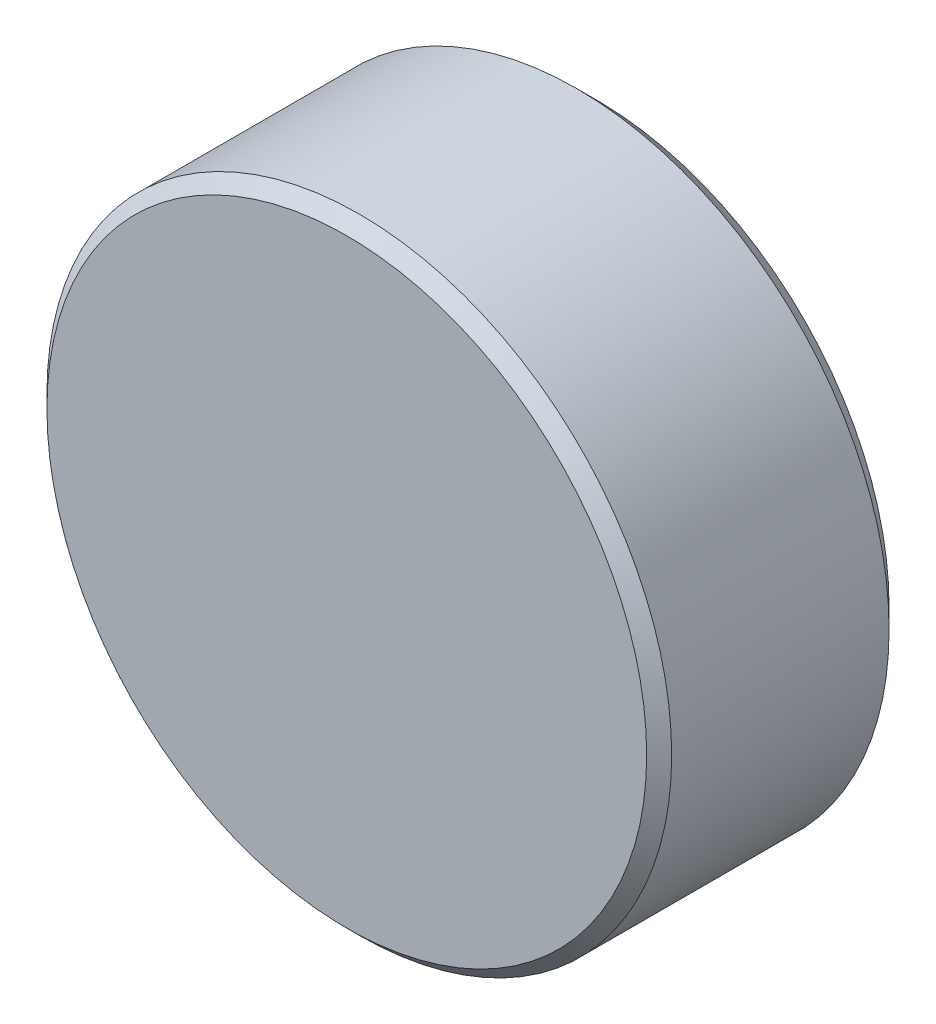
ISO-10303-21;
HEADER;
FILE_DESCRIPTION(('STEP AP214'),'2;1');
FILE_NAME('part.step','',(''),(''),'','','');
FILE_SCHEMA(('AUTOMOTIVE_DESIGN { 1 0 10303 214 1 1 1 1 }'));
ENDSEC;
DATA;
#1=APPLICATION_CONTEXT('core data for automotive mechanical design processes');
#2=APPLICATION_PROTOCOL_DEFINITION('international standard','automotive_design',2000,#1);
#3=PRODUCT_CONTEXT('',#1,'mechanical');
#4=PRODUCT('Part','Part','',(#3));
#5=PRODUCT_RELATED_PRODUCT_CATEGORY('part','',(#4));
#6=PRODUCT_DEFINITION_FORMATION('','',#4);
#7=PRODUCT_DEFINITION_CONTEXT('part definition',#1,'design');
#8=PRODUCT_DEFINITION('design','',#6,#7);
#9=PRODUCT_DEFINITION_SHAPE('','',#8);
#10=(LENGTH_UNIT() NAMED_UNIT(*) SI_UNIT(.MILLI.,.METRE.));
#11=(NAMED_UNIT(*) PLANE_ANGLE_UNIT() SI_UNIT($,.RADIAN.));
#12=(NAMED_UNIT(*) SI_UNIT($,.STERADIAN.) SOLID_ANGLE_UNIT());
#13=UNCERTAINTY_MEASURE_WITH_UNIT(LENGTH_MEASURE(1.E-05),#10,'distance_accuracy_value','');
#14=(GEOMETRIC_REPRESENTATION_CONTEXT(3) GLOBAL_UNCERTAINTY_ASSIGNED_CONTEXT((#13)) GLOBAL_UNIT_ASSIGNED_CONTEXT((#10,
#11,#12)) REPRESENTATION_CONTEXT('',''));
#15=CARTESIAN_POINT('',(0.,0.,0.));
#16=DIRECTION('',(0.,0.,1.));
#17=DIRECTION('',(1.,0.,0.));
#18=AXIS2_PLACEMENT_3D('',#15,#16,#17);
#19=CARTESIAN_POINT('',(0.,0.,30.));
#20=DIRECTION('',(0.,0.,1.));
#21=DIRECTION('',(1.,0.,0.));
#22=AXIS2_PLACEMENT_3D('',#19,#20,#21);
#23=CYLINDRICAL_SURFACE('',#22,12.5);
#24=CARTESIAN_POINT('',(0.,0.,0.8));
#25=DIRECTION('',(0.,0.,1.));
#26=DIRECTION('',(1.,0.,0.));
#27=AXIS2_PLACEMENT_3D('',#24,#25,#26);
#28=CIRCLE('',#27,12.5);
#29=CARTESIAN_POINT('',(12.5,0.,0.8));
#30=VERTEX_POINT('',#29);
#31=EDGE_CURVE('E21',#30,#30,#28,.T.);
#32=ORIENTED_EDGE('',*,*,#31,.T.);
#33=EDGE_LOOP('',(#32));
#34=FACE_BOUND('',#33,.T.);
#35=CARTESIAN_POINT('',(0.,0.,9.5));
#36=DIRECTION('',(0.,0.,-1.));
#37=DIRECTION('',(-1.,0.,0.));
#38=AXIS2_PLACEMENT_3D('',#35,#36,#37);
#39=CIRCLE('',#38,12.5);
#40=CARTESIAN_POINT('',(-12.5,0.,9.5));
#41=VERTEX_POINT('',#40);
#42=EDGE_CURVE('E27',#41,#41,#39,.T.);
#43=ORIENTED_EDGE('',*,*,#42,.T.);
#44=EDGE_LOOP('',(#43));
#45=FACE_BOUND('',#44,.T.);
#46=ADVANCED_FACE('F13',(#34,#45),#23,.T.);
#47=CARTESIAN_POINT('',(12.5,0.,10.));
#48=DIRECTION('',(0.,0.,-1.));
#49=DIRECTION('',(-1.,0.,0.));
#50=AXIS2_PLACEMENT_3D('',#47,#48,#49);
#51=PLANE('',#50);
#52=CARTESIAN_POINT('',(0.,0.,10.));
#53=DIRECTION('',(0.,0.,-1.));
#54=DIRECTION('',(-1.,0.,0.));
#55=AXIS2_PLACEMENT_3D('',#52,#53,#54);
#56=CIRCLE('',#55,12.);
#57=CARTESIAN_POINT('',(-12.,0.,10.));
#58=VERTEX_POINT('',#57);
#59=EDGE_CURVE('E32',#58,#58,#56,.F.);
#60=ORIENTED_EDGE('',*,*,#59,.T.);
#61=EDGE_LOOP('',(#60));
#62=FACE_BOUND('',#61,.T.);
#63=ADVANCED_FACE('F57',(#62),#51,.F.);
#64=CARTESIAN_POINT('',(0.,0.,5.));
#65=DIRECTION('',(0.,0.,1.));
#66=DIRECTION('',(1.,0.,0.));
#67=AXIS2_PLACEMENT_3D('',#64,#65,#66);
#68=PLANE('',#67);
#69=CARTESIAN_POINT('',(0.,0.,5.));
#70=DIRECTION('',(0.,0.,1.));
#71=DIRECTION('',(1.,0.,0.));
#72=AXIS2_PLACEMENT_3D('',#69,#70,#71);
#73=CIRCLE('',#72,3.);
#74=CARTESIAN_POINT('',(3.,0.,5.));
#75=VERTEX_POINT('',#74);
#76=EDGE_CURVE('E38',#75,#75,#73,.T.);
#77=ORIENTED_EDGE('',*,*,#76,.F.);
#78=EDGE_LOOP('',(#77));
#79=FACE_BOUND('',#78,.T.);
#80=ADVANCED_FACE('F52',(#79),#68,.F.);
#81=CARTESIAN_POINT('',(0.,0.,30.));
#82=DIRECTION('',(0.,0.,1.));
#83=DIRECTION('',(1.,0.,0.));
#84=AXIS2_PLACEMENT_3D('',#81,#82,#83);
#85=CYLINDRICAL_SURFACE('',#84,3.);
#86=CARTESIAN_POINT('',(0.,0.,0.));
#87=DIRECTION('',(0.,0.,1.));
#88=DIRECTION('',(1.,0.,0.));
#89=AXIS2_PLACEMENT_3D('',#86,#87,#88);
#90=CIRCLE('',#89,3.);
#91=CARTESIAN_POINT('',(3.,0.,0.));
#92=VERTEX_POINT('',#91);
#93=EDGE_CURVE('E42',#92,#92,#90,.T.);
#94=ORIENTED_EDGE('',*,*,#93,.F.);
#95=EDGE_LOOP('',(#94));
#96=FACE_BOUND('',#95,.T.);
#97=ORIENTED_EDGE('',*,*,#76,.T.);
#98=EDGE_LOOP('',(#97));
#99=FACE_BOUND('',#98,.T.);
#100=ADVANCED_FACE('F49',(#96,#99),#85,.F.);
#101=CARTESIAN_POINT('',(3.,0.,0.));
#102=DIRECTION('',(0.,0.,1.));
#103=DIRECTION('',(1.,0.,0.));
#104=AXIS2_PLACEMENT_3D('',#101,#102,#103);
#105=PLANE('',#104);
#106=CARTESIAN_POINT('',(0.,0.,0.));
#107=DIRECTION('',(0.,0.,1.));
#108=DIRECTION('',(1.,0.,0.));
#109=AXIS2_PLACEMENT_3D('',#106,#107,#108);
#110=CIRCLE('',#109,11.7);
#111=CARTESIAN_POINT('',(11.7,0.,0.));
#112=VERTEX_POINT('',#111);
#113=EDGE_CURVE('E8',#112,#112,#110,.F.);
#114=ORIENTED_EDGE('',*,*,#113,.T.);
#115=EDGE_LOOP('',(#114));
#116=FACE_BOUND('',#115,.T.);
#117=ORIENTED_EDGE('',*,*,#93,.T.);
#118=EDGE_LOOP('',(#117));
#119=FACE_BOUND('',#118,.T.);
#120=ADVANCED_FACE('F47',(#116,#119),#105,.F.);
#121=CARTESIAN_POINT('',(0.,0.,10.));
#122=DIRECTION('',(0.,0.,-1.));
#123=DIRECTION('',(-1.,0.,0.));
#124=AXIS2_PLACEMENT_3D('',#121,#122,#123);
#125=CONICAL_SURFACE('',#124,12.,0.785398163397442);
#126=ORIENTED_EDGE('',*,*,#42,.F.);
#127=EDGE_LOOP('',(#126));
#128=FACE_BOUND('',#127,.T.);
#129=ORIENTED_EDGE('',*,*,#59,.F.);
#130=EDGE_LOOP('',(#129));
#131=FACE_BOUND('',#130,.T.);
#132=ADVANCED_FACE('F72',(#128,#131),#125,.T.);
#133=CARTESIAN_POINT('',(0.,0.,0.8));
#134=DIRECTION('',(0.,0.,1.));
#135=DIRECTION('',(1.,0.,0.));
#136=AXIS2_PLACEMENT_3D('',#133,#134,#135);
#137=CONICAL_SURFACE('',#136,12.5,0.78539816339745);
#138=ORIENTED_EDGE('',*,*,#113,.F.);
#139=EDGE_LOOP('',(#138));
#140=FACE_BOUND('',#139,.T.);
#141=ORIENTED_EDGE('',*,*,#31,.F.);
#142=EDGE_LOOP('',(#141));
#143=FACE_BOUND('',#142,.T.);
#144=ADVANCED_FACE('F15',(#140,#143),#137,.T.);
#145=CLOSED_SHELL('',(#46,#63,#80,#100,#120,#132,#144));
#146=MANIFOLD_SOLID_BREP('B1',#145);
#147=ADVANCED_BREP_SHAPE_REPRESENTATION('',(#18,#146),#14);
#148=SHAPE_DEFINITION_REPRESENTATION(#9,#147);
ENDSEC;
END-ISO-10303-21;
